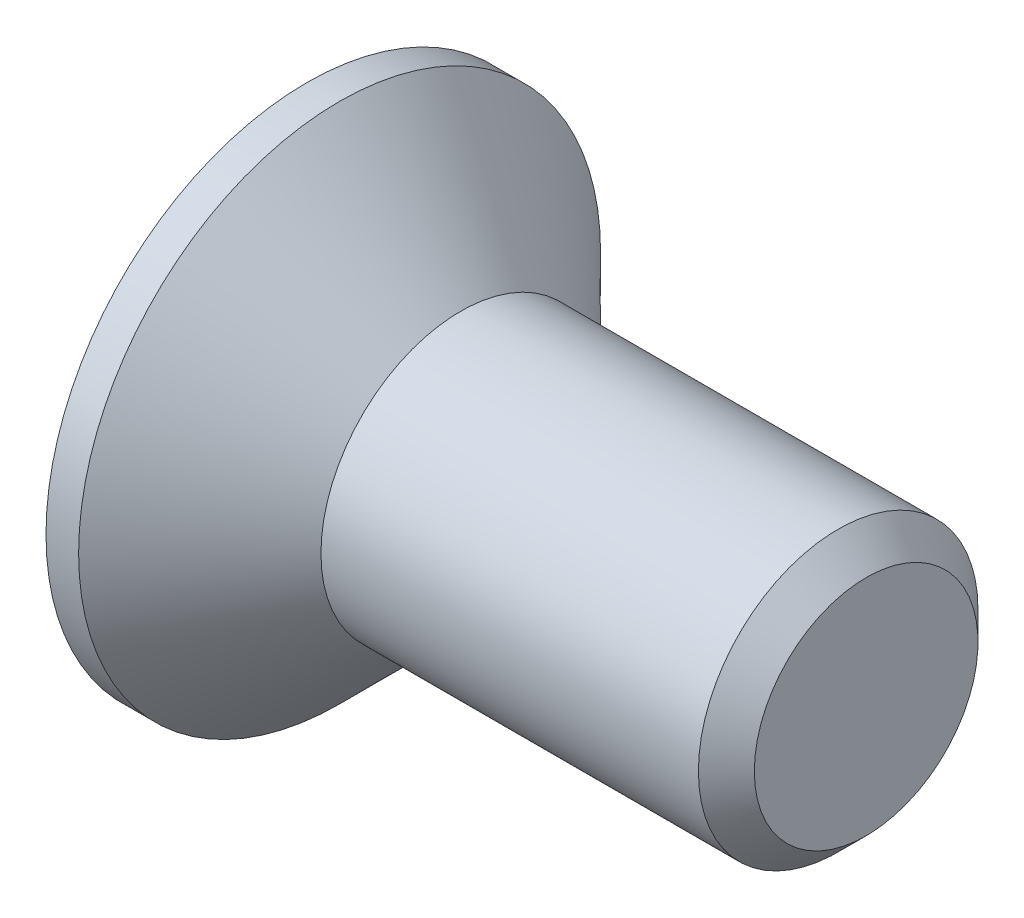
from build123d import *

# Parameters (mm, degrees)
CHAMFER1_SIZE      = 0.3
CUT_EXTRUDE1_DEPTH = 1.25


with BuildPart() as part:
    # Sketch1 → Revolve1 (revolve)
    with BuildSketch(Plane.XY, mode=Mode.PRIVATE) as revolve1_sk:
        Polygon((-1.65, 2.8), (-1.65, 0), (4.35, 0), (4.35, 1.5), (0, 1.5), (-1.3, 2.8), align=None)
    revolve(revolve1_sk.sketch.rotate(Axis((-1.65, 0, 0), (1, 0, 0)), 90), axis=Axis((-1.65, 0, 0), (1, 0, 0)))

    # Chamfer1
    chamfer1_edges = [part.edges().sort_by_distance(p)[0] for p in [
        (4.35, 0, -1.5),
    ]]
    chamfer(chamfer1_edges, length=CHAMFER1_SIZE)

    # Sketch2 → Cut-Extrude1 (cut)
    with BuildSketch(Plane.ZY.offset(1.65)):
        Polygon((-0.365, 1.45), (0.365, 1.45), (0.365, 0.365), (1.45, 0.365), (1.45, -0.365), (0.365, -0.365), (0.365, -1.45), (-0.365, -1.45), (-0.365, -0.365), (-1.45, -0.365), (-1.45, 0.365), (-0.365, 0.365), align=None)
    extrude(amount=-CUT_EXTRUDE1_DEPTH, mode=Mode.SUBTRACT)


solid = part.part
